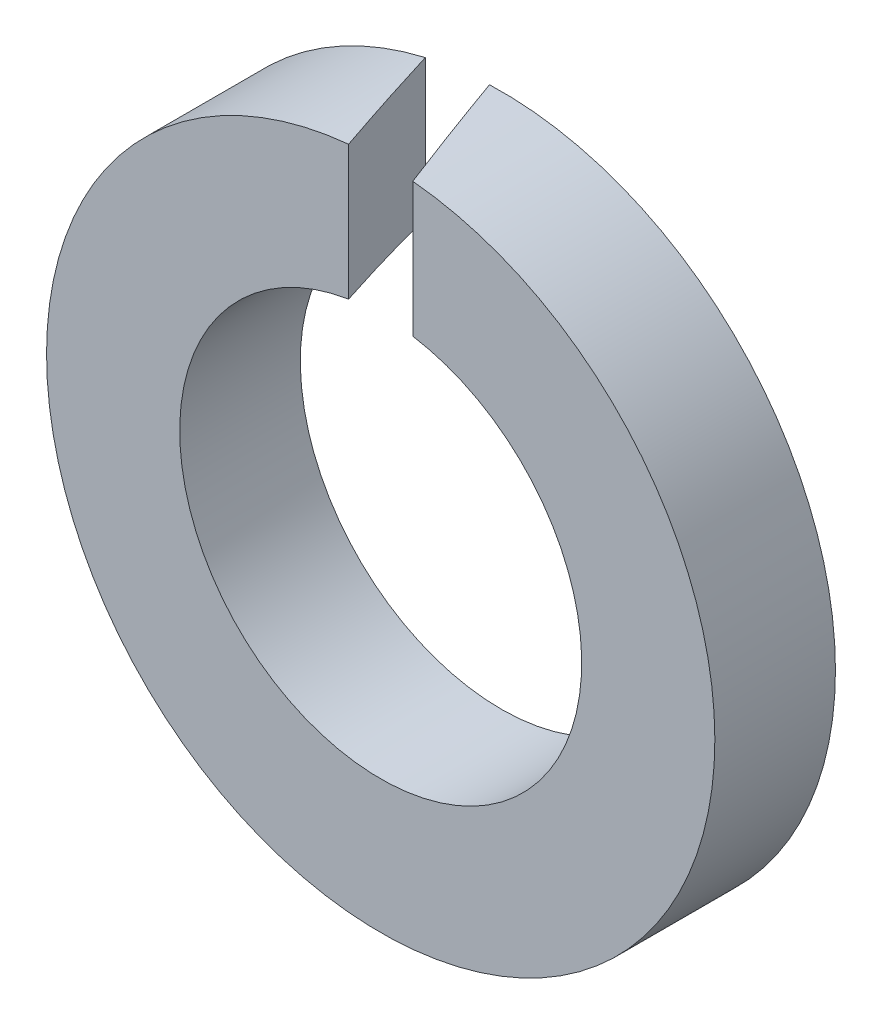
from build123d import *

# Parameters (mm, degrees)
SKETCH1_R          = 13.3
SKETCH1_R_2        = 8
BASE_EXTRUDE_DEPTH = 4.8
CUT_EXTRUDE1_DEPTH = 22.196966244


with BuildPart() as part:
    # Sketch1 → Base-Extrude (new body)
    with BuildSketch(Plane.XY):
        Circle(SKETCH1_R)
        Circle(SKETCH1_R_2, mode=Mode.SUBTRACT)
    extrude(amount=-BASE_EXTRUDE_DEPTH)

    # Sketch2 → Cut-Extrude1 (cut, through all)
    with BuildSketch(Plane(origin=(-3.021630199, 0, -2.345256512), x_dir=(0, 0, -1), z_dir=(0, 1, 0))):
        Polygon((-2.345256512, -1.744616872), (2.454743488, 0.002440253), (2.454743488, -2.551586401), (-2.345256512, -4.298643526), align=None)
    extrude(amount=CUT_EXTRUDE1_DEPTH, mode=Mode.SUBTRACT)


solid = part.part
